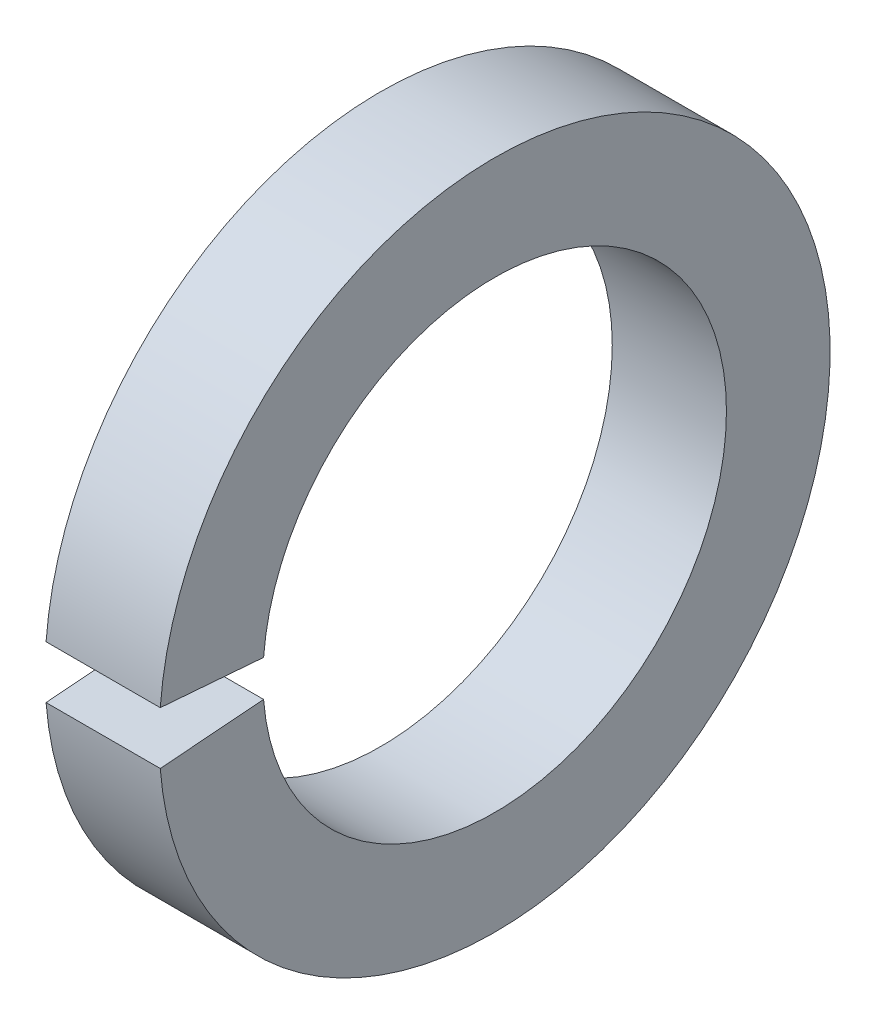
from build123d import *

# Parameters (mm, degrees)
SKETCH1_W = 6.35
SKETCH1_H = 5.7658
GAP_DEPTH = 28.137383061


with BuildPart() as part:
    # Sketch1 → Base-Revolve (revolve)
    with BuildSketch(Plane.XY, mode=Mode.PRIVATE) as base_revolve_sk:
        with Locations((-3.175, 15.7734)):
            Rectangle(SKETCH1_W, SKETCH1_H)
    revolve(base_revolve_sk.sketch.rotate(Axis((-34.925, 0, 0), (1, 0, 0)), 90), axis=Axis((-34.925, 0, 0), (1, 0, 0)))

    # Sketch2 → Gap (cut, through all)
    with BuildSketch(Plane(origin=(0, 0, 0), x_dir=(0, -1, 0), z_dir=(-1, 0, 0))):
        with BuildLine():
            Line((0, 0), (1.493031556, 18.97076463))
            ThreePointArc((1.493031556, 18.97076463), (0, 19.029426), (-1.493031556, 18.97076463))
            Line((-1.493031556, 18.97076463), (0, 0))
        make_face()
    extrude(amount=GAP_DEPTH, mode=Mode.SUBTRACT)


solid = part.part
